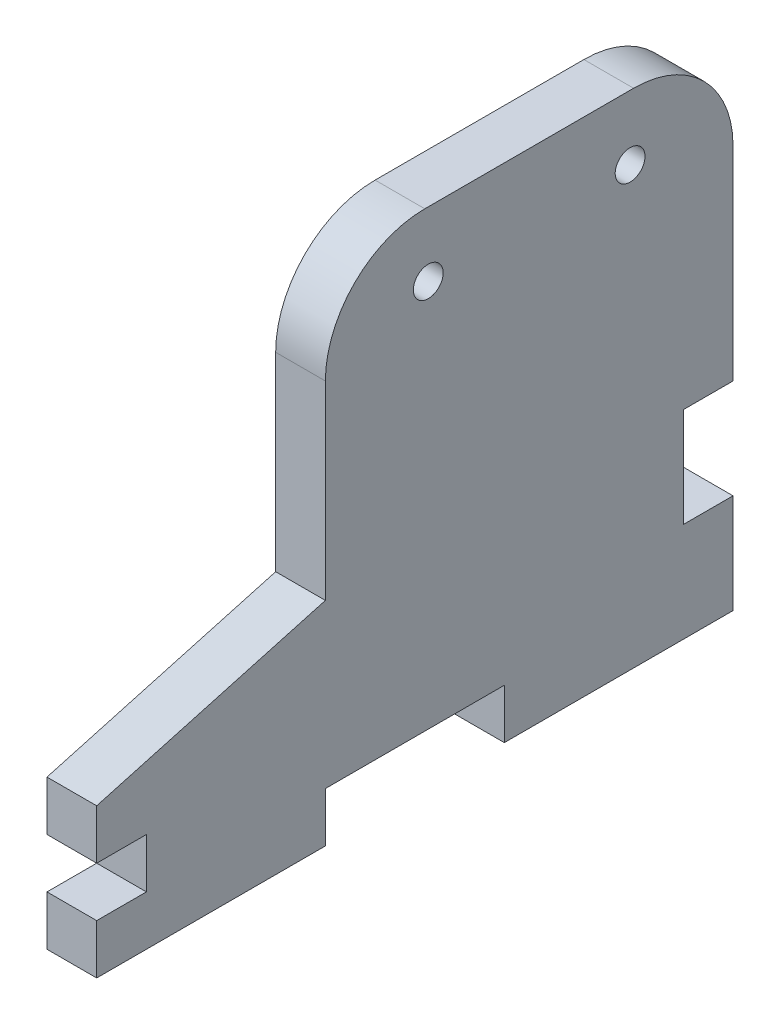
from build123d import *

# Parameters (mm, degrees)
BOSS_EXTRU_1_DEPTH           = 5
ESQUISSE3_W                  = 5
ESQUISSE3_H                  = 10
BOSS_EXTRU_2_DEPTH           = 5
ENL_V_MAT_EXTRU_1_DEPTH      = 49.892171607
ENL_V_MAT_EXTRU_1_DEPTH_BACK = 49.892171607
ESQUISSE4_W                  = 18
ESQUISSE4_H                  = 5
ESQUISSE4_W_2                = 5
ESQUISSE5_R                  = 1.5
BOSS_EXTRU_3_DEPTH           = 5
CONG_1_R                     = 10


with BuildPart() as part:
    # Esquisse1 → Boss.-Extru.1 (new body)
    with BuildSketch(Plane(origin=(0, 0, 0), x_dir=(0, 0, -1), z_dir=(1, 0, 0))):
        Polygon((-19.666666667, 5), (-19.666666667, -10), (39.333333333, -10), (39.333333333, 20), (34.333333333, 20), align=None)
    extrude(amount=BOSS_EXTRU_1_DEPTH)

    # Esquisse3 → Boss.-Extru.2 (add)
    with BuildSketch(Plane(origin=(5, 0, 0), x_dir=(0, 0, -1), z_dir=(1, 0, 0))):
        with Locations((41.833333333, 15)):
            Rectangle(ESQUISSE3_W, ESQUISSE3_H)
        with Locations((41.833333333, -5)):
            Rectangle(ESQUISSE3_W, ESQUISSE3_H)
    extrude(amount=-BOSS_EXTRU_2_DEPTH)

    # Esquisse4 → Enl_v. mat.-Extru.1 (cut, two sides: drawn at the far end of the back side and taken through both)
    with BuildSketch(Plane(origin=(5, 0, 0), x_dir=(0, 0, -1), z_dir=(1, 0, 0)).offset(-ENL_V_MAT_EXTRU_1_DEPTH_BACK)):
        with Locations((12.333333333, -7.5)):
            Rectangle(ESQUISSE4_W, ESQUISSE4_H)
        with Locations((-17.166666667, -2.5)):
            Rectangle(ESQUISSE4_W_2, ESQUISSE4_H)
    extrude(amount=ENL_V_MAT_EXTRU_1_DEPTH + ENL_V_MAT_EXTRU_1_DEPTH_BACK, mode=Mode.SUBTRACT)

    # Esquisse5 → Boss.-Extru.3 (add)
    with BuildSketch(Plane(origin=(5, 0, 0), x_dir=(0, 0, -1), z_dir=(1, 0, 0))):
        Polygon((3.333333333, 11.388888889), (3.333333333, 40.5), (44.333333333, 40.5), (44.333333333, 20), (34.333333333, 20), align=None)
        with Locations((13.683333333, 34)):
            Circle(ESQUISSE5_R, mode=Mode.SUBTRACT)
        with Locations((33.983333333, 34)):
            Circle(ESQUISSE5_R, mode=Mode.SUBTRACT)
    extrude(amount=-BOSS_EXTRU_3_DEPTH)

    # Cong_1
    cong_1_edges = [part.edges().sort_by_distance(p)[0] for p in [
        (2.5, 40.5, -44.333333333),
        (2.5, 40.5, -3.333333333),
    ]]
    fillet(cong_1_edges, radius=CONG_1_R)


solid = part.part
